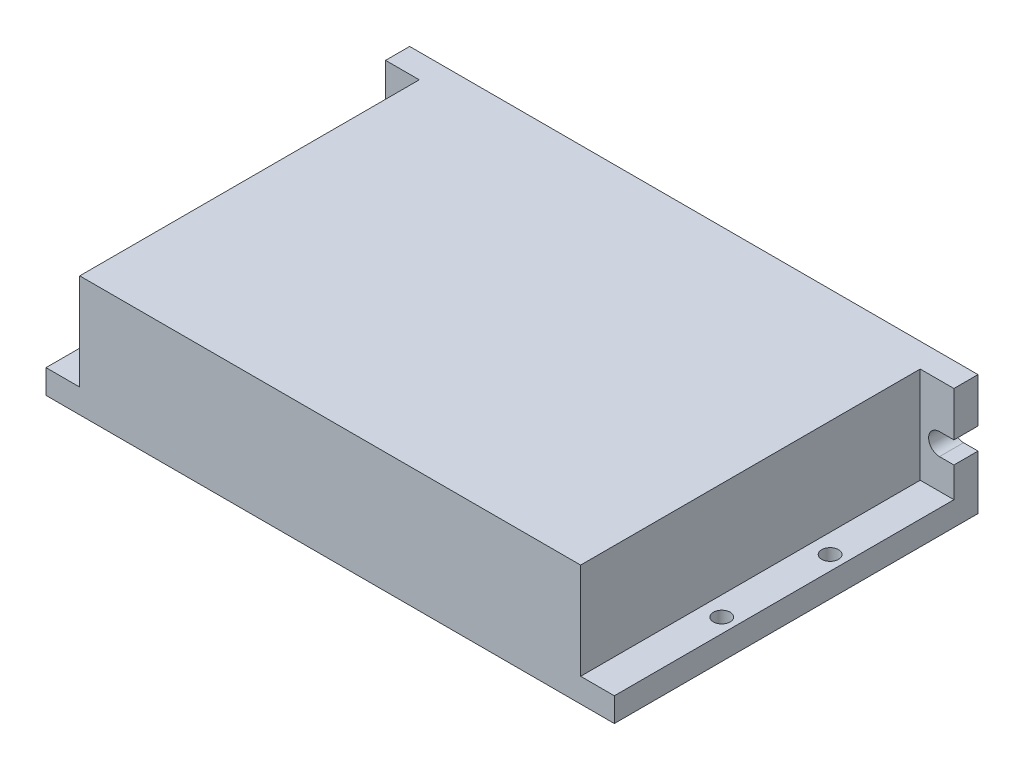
ISO-10303-21;
HEADER;
FILE_DESCRIPTION(('STEP AP214'),'2;1');
FILE_NAME('part.step','',(''),(''),'','','');
FILE_SCHEMA(('AUTOMOTIVE_DESIGN { 1 0 10303 214 1 1 1 1 }'));
ENDSEC;
DATA;
#1=APPLICATION_CONTEXT('core data for automotive mechanical design processes');
#2=APPLICATION_PROTOCOL_DEFINITION('international standard','automotive_design',2000,#1);
#3=PRODUCT_CONTEXT('',#1,'mechanical');
#4=PRODUCT('Part','Part','',(#3));
#5=PRODUCT_RELATED_PRODUCT_CATEGORY('part','',(#4));
#6=PRODUCT_DEFINITION_FORMATION('','',#4);
#7=PRODUCT_DEFINITION_CONTEXT('part definition',#1,'design');
#8=PRODUCT_DEFINITION('design','',#6,#7);
#9=PRODUCT_DEFINITION_SHAPE('','',#8);
#10=(LENGTH_UNIT() NAMED_UNIT(*) SI_UNIT(.MILLI.,.METRE.));
#11=(NAMED_UNIT(*) PLANE_ANGLE_UNIT() SI_UNIT($,.RADIAN.));
#12=(NAMED_UNIT(*) SI_UNIT($,.STERADIAN.) SOLID_ANGLE_UNIT());
#13=UNCERTAINTY_MEASURE_WITH_UNIT(LENGTH_MEASURE(1.E-05),#10,'distance_accuracy_value','');
#14=(GEOMETRIC_REPRESENTATION_CONTEXT(3) GLOBAL_UNCERTAINTY_ASSIGNED_CONTEXT((#13)) GLOBAL_UNIT_ASSIGNED_CONTEXT((#10,
#11,#12)) REPRESENTATION_CONTEXT('',''));
#15=CARTESIAN_POINT('',(0.,0.,0.));
#16=DIRECTION('',(0.,0.,1.));
#17=DIRECTION('',(1.,0.,0.));
#18=AXIS2_PLACEMENT_3D('',#15,#16,#17);
#19=CARTESIAN_POINT('',(59.,25.,37.75));
#20=DIRECTION('',(-1.,0.,0.));
#21=DIRECTION('',(0.,0.,1.));
#22=AXIS2_PLACEMENT_3D('',#19,#20,#21);
#23=PLANE('',#22);
#24=DIRECTION('',(0.,-1.,0.));
#25=VECTOR('',#24,1.);
#26=CARTESIAN_POINT('',(59.,25.,-37.75));
#27=LINE('',#26,#25);
#28=CARTESIAN_POINT('',(59.,11.25,-37.75));
#29=VERTEX_POINT('',#28);
#30=CARTESIAN_POINT('',(59.,0.,-37.75));
#31=VERTEX_POINT('',#30);
#32=EDGE_CURVE('E43',#29,#31,#27,.T.);
#33=ORIENTED_EDGE('',*,*,#32,.F.);
#34=DIRECTION('',(0.,0.,1.));
#35=VECTOR('',#34,1.);
#36=CARTESIAN_POINT('',(59.,11.25,-37.75));
#37=LINE('',#36,#35);
#38=CARTESIAN_POINT('',(59.,11.25,-32.75));
#39=VERTEX_POINT('',#38);
#40=EDGE_CURVE('E325',#29,#39,#37,.T.);
#41=ORIENTED_EDGE('',*,*,#40,.T.);
#42=DIRECTION('',(0.,1.,0.));
#43=VECTOR('',#42,1.);
#44=CARTESIAN_POINT('',(59.,5.,-32.75));
#45=LINE('',#44,#43);
#46=CARTESIAN_POINT('',(59.,5.,-32.75));
#47=VERTEX_POINT('',#46);
#48=EDGE_CURVE('E284',#47,#39,#45,.T.);
#49=ORIENTED_EDGE('',*,*,#48,.F.);
#50=DIRECTION('',(0.,0.,1.));
#51=VECTOR('',#50,1.);
#52=CARTESIAN_POINT('',(59.,5.,-32.75));
#53=LINE('',#52,#51);
#54=CARTESIAN_POINT('',(59.,5.,37.75));
#55=VERTEX_POINT('',#54);
#56=EDGE_CURVE('E254',#47,#55,#53,.T.);
#57=ORIENTED_EDGE('',*,*,#56,.T.);
#58=DIRECTION('',(0.,-1.,0.));
#59=VECTOR('',#58,1.);
#60=CARTESIAN_POINT('',(59.,25.,37.75));
#61=LINE('',#60,#59);
#62=CARTESIAN_POINT('',(59.,0.,37.75));
#63=VERTEX_POINT('',#62);
#64=EDGE_CURVE('E196',#55,#63,#61,.T.);
#65=ORIENTED_EDGE('',*,*,#64,.T.);
#66=DIRECTION('',(0.,0.,-1.));
#67=VECTOR('',#66,1.);
#68=CARTESIAN_POINT('',(59.,0.,37.75));
#69=LINE('',#68,#67);
#70=EDGE_CURVE('E197',#63,#31,#69,.T.);
#71=ORIENTED_EDGE('',*,*,#70,.T.);
#72=EDGE_LOOP('',(#33,#41,#49,#57,#65,#71));
#73=FACE_BOUND('',#72,.T.);
#74=ADVANCED_FACE('F35',(#73),#23,.F.);
#75=CARTESIAN_POINT('',(-59.,25.,37.75));
#76=DIRECTION('',(1.,0.,0.));
#77=DIRECTION('',(0.,0.,-1.));
#78=AXIS2_PLACEMENT_3D('',#75,#76,#77);
#79=PLANE('',#78);
#80=DIRECTION('',(0.,-1.,0.));
#81=VECTOR('',#80,1.);
#82=CARTESIAN_POINT('',(-59.,5.,-32.75));
#83=LINE('',#82,#81);
#84=CARTESIAN_POINT('',(-59.,11.25,-32.75));
#85=VERTEX_POINT('',#84);
#86=CARTESIAN_POINT('',(-59.,5.,-32.75));
#87=VERTEX_POINT('',#86);
#88=EDGE_CURVE('E241',#85,#87,#83,.T.);
#89=ORIENTED_EDGE('',*,*,#88,.F.);
#90=DIRECTION('',(0.,0.,1.));
#91=VECTOR('',#90,1.);
#92=CARTESIAN_POINT('',(-59.,11.25,-37.75));
#93=LINE('',#92,#91);
#94=CARTESIAN_POINT('',(-59.,11.25,-37.75));
#95=VERTEX_POINT('',#94);
#96=EDGE_CURVE('E222',#95,#85,#93,.T.);
#97=ORIENTED_EDGE('',*,*,#96,.F.);
#98=DIRECTION('',(0.,-1.,0.));
#99=VECTOR('',#98,1.);
#100=CARTESIAN_POINT('',(-59.,25.,-37.75));
#101=LINE('',#100,#99);
#102=CARTESIAN_POINT('',(-59.,0.,-37.75));
#103=VERTEX_POINT('',#102);
#104=EDGE_CURVE('E211',#95,#103,#101,.T.);
#105=ORIENTED_EDGE('',*,*,#104,.T.);
#106=DIRECTION('',(0.,0.,1.));
#107=VECTOR('',#106,1.);
#108=CARTESIAN_POINT('',(-59.,0.,37.75));
#109=LINE('',#108,#107);
#110=CARTESIAN_POINT('',(-59.,0.,37.75));
#111=VERTEX_POINT('',#110);
#112=EDGE_CURVE('E204',#103,#111,#109,.T.);
#113=ORIENTED_EDGE('',*,*,#112,.T.);
#114=DIRECTION('',(0.,-1.,0.));
#115=VECTOR('',#114,1.);
#116=CARTESIAN_POINT('',(-59.,25.,37.75));
#117=LINE('',#116,#115);
#118=CARTESIAN_POINT('',(-59.,5.,37.75));
#119=VERTEX_POINT('',#118);
#120=EDGE_CURVE('E210',#119,#111,#117,.T.);
#121=ORIENTED_EDGE('',*,*,#120,.F.);
#122=DIRECTION('',(0.,0.,1.));
#123=VECTOR('',#122,1.);
#124=CARTESIAN_POINT('',(-59.,5.,-32.75));
#125=LINE('',#124,#123);
#126=EDGE_CURVE('E240',#87,#119,#125,.T.);
#127=ORIENTED_EDGE('',*,*,#126,.F.);
#128=EDGE_LOOP('',(#89,#97,#105,#113,#121,#127));
#129=FACE_BOUND('',#128,.T.);
#130=ADVANCED_FACE('F218',(#129),#79,.F.);
#131=CARTESIAN_POINT('',(0.,0.,0.));
#132=DIRECTION('',(0.,-1.,0.));
#133=DIRECTION('',(0.,0.,-1.));
#134=AXIS2_PLACEMENT_3D('',#131,#132,#133);
#135=PLANE('',#134);
#136=CARTESIAN_POINT('',(56.,0.,-10.05));
#137=DIRECTION('',(0.,1.,0.));
#138=DIRECTION('',(0.,0.,1.));
#139=AXIS2_PLACEMENT_3D('',#136,#137,#138);
#140=CIRCLE('',#139,1.75);
#141=CARTESIAN_POINT('',(56.,0.,-8.3));
#142=VERTEX_POINT('',#141);
#143=EDGE_CURVE('E299',#142,#142,#140,.T.);
#144=ORIENTED_EDGE('',*,*,#143,.T.);
#145=EDGE_LOOP('',(#144));
#146=FACE_BOUND('',#145,.T.);
#147=CARTESIAN_POINT('',(-56.,0.,-10.05));
#148=DIRECTION('',(0.,1.,0.));
#149=DIRECTION('',(0.,0.,1.));
#150=AXIS2_PLACEMENT_3D('',#147,#148,#149);
#151=CIRCLE('',#150,1.75);
#152=CARTESIAN_POINT('',(-56.,0.,-8.3));
#153=VERTEX_POINT('',#152);
#154=EDGE_CURVE('E287',#153,#153,#151,.T.);
#155=ORIENTED_EDGE('',*,*,#154,.T.);
#156=EDGE_LOOP('',(#155));
#157=FACE_BOUND('',#156,.T.);
#158=ORIENTED_EDGE('',*,*,#70,.F.);
#159=DIRECTION('',(1.,0.,0.));
#160=VECTOR('',#159,1.);
#161=CARTESIAN_POINT('',(-59.,0.,37.75));
#162=LINE('',#161,#160);
#163=EDGE_CURVE('E190',#111,#63,#162,.T.);
#164=ORIENTED_EDGE('',*,*,#163,.F.);
#165=ORIENTED_EDGE('',*,*,#112,.F.);
#166=DIRECTION('',(-1.,0.,0.));
#167=VECTOR('',#166,1.);
#168=CARTESIAN_POINT('',(-59.,0.,-37.75));
#169=LINE('',#168,#167);
#170=EDGE_CURVE('E200',#31,#103,#169,.T.);
#171=ORIENTED_EDGE('',*,*,#170,.F.);
#172=EDGE_LOOP('',(#158,#164,#165,#171));
#173=FACE_BOUND('',#172,.T.);
#174=CARTESIAN_POINT('',(-56.,0.,12.45));
#175=DIRECTION('',(0.,1.,0.));
#176=DIRECTION('',(0.,0.,1.));
#177=AXIS2_PLACEMENT_3D('',#174,#175,#176);
#178=CIRCLE('',#177,1.75);
#179=CARTESIAN_POINT('',(-56.,0.,14.2));
#180=VERTEX_POINT('',#179);
#181=EDGE_CURVE('E293',#180,#180,#178,.T.);
#182=ORIENTED_EDGE('',*,*,#181,.T.);
#183=EDGE_LOOP('',(#182));
#184=FACE_BOUND('',#183,.T.);
#185=CARTESIAN_POINT('',(56.,0.,12.45));
#186=DIRECTION('',(0.,1.,0.));
#187=DIRECTION('',(0.,0.,1.));
#188=AXIS2_PLACEMENT_3D('',#185,#186,#187);
#189=CIRCLE('',#188,1.75);
#190=CARTESIAN_POINT('',(56.,0.,14.2));
#191=VERTEX_POINT('',#190);
#192=EDGE_CURVE('E305',#191,#191,#189,.T.);
#193=ORIENTED_EDGE('',*,*,#192,.T.);
#194=EDGE_LOOP('',(#193));
#195=FACE_BOUND('',#194,.T.);
#196=ADVANCED_FACE('F229',(#146,#157,#173,#184,#195),#135,.T.);
#197=CARTESIAN_POINT('',(52.,5.,-32.75));
#198=DIRECTION('',(0.,-1.,0.));
#199=DIRECTION('',(0.,0.,-1.));
#200=AXIS2_PLACEMENT_3D('',#197,#198,#199);
#201=PLANE('',#200);
#202=CARTESIAN_POINT('',(56.,5.,-10.05));
#203=DIRECTION('',(0.,1.,0.));
#204=DIRECTION('',(0.,0.,1.));
#205=AXIS2_PLACEMENT_3D('',#202,#203,#204);
#206=CIRCLE('',#205,1.75);
#207=CARTESIAN_POINT('',(56.,5.,-8.3));
#208=VERTEX_POINT('',#207);
#209=EDGE_CURVE('E296',#208,#208,#206,.T.);
#210=ORIENTED_EDGE('',*,*,#209,.F.);
#211=EDGE_LOOP('',(#210));
#212=FACE_BOUND('',#211,.T.);
#213=DIRECTION('',(1.,0.,0.));
#214=VECTOR('',#213,1.);
#215=CARTESIAN_POINT('',(52.,5.,37.75));
#216=LINE('',#215,#214);
#217=CARTESIAN_POINT('',(52.,5.,37.75));
#218=VERTEX_POINT('',#217);
#219=EDGE_CURVE('E270',#218,#55,#216,.T.);
#220=ORIENTED_EDGE('',*,*,#219,.T.);
#221=ORIENTED_EDGE('',*,*,#56,.F.);
#222=DIRECTION('',(1.,0.,0.));
#223=VECTOR('',#222,1.);
#224=CARTESIAN_POINT('',(52.,5.,-32.75));
#225=LINE('',#224,#223);
#226=CARTESIAN_POINT('',(52.,5.,-32.75));
#227=VERTEX_POINT('',#226);
#228=EDGE_CURVE('E266',#227,#47,#225,.T.);
#229=ORIENTED_EDGE('',*,*,#228,.F.);
#230=DIRECTION('',(0.,0.,1.));
#231=VECTOR('',#230,1.);
#232=CARTESIAN_POINT('',(52.,5.,-32.75));
#233=LINE('',#232,#231);
#234=EDGE_CURVE('E265',#227,#218,#233,.T.);
#235=ORIENTED_EDGE('',*,*,#234,.T.);
#236=EDGE_LOOP('',(#220,#221,#229,#235));
#237=FACE_BOUND('',#236,.T.);
#238=CARTESIAN_POINT('',(56.,5.,12.45));
#239=DIRECTION('',(0.,1.,0.));
#240=DIRECTION('',(0.,0.,1.));
#241=AXIS2_PLACEMENT_3D('',#238,#239,#240);
#242=CIRCLE('',#241,1.75);
#243=CARTESIAN_POINT('',(56.,5.,14.2));
#244=VERTEX_POINT('',#243);
#245=EDGE_CURVE('E302',#244,#244,#242,.T.);
#246=ORIENTED_EDGE('',*,*,#245,.F.);
#247=EDGE_LOOP('',(#246));
#248=FACE_BOUND('',#247,.T.);
#249=ADVANCED_FACE('F356',(#212,#237,#248),#201,.F.);
#250=CARTESIAN_POINT('',(-52.,5.,-32.75));
#251=DIRECTION('',(0.,-1.,0.));
#252=DIRECTION('',(0.,0.,-1.));
#253=AXIS2_PLACEMENT_3D('',#250,#251,#252);
#254=PLANE('',#253);
#255=CARTESIAN_POINT('',(-56.,5.,-10.05));
#256=DIRECTION('',(0.,1.,0.));
#257=DIRECTION('',(0.,0.,1.));
#258=AXIS2_PLACEMENT_3D('',#255,#256,#257);
#259=CIRCLE('',#258,1.75);
#260=CARTESIAN_POINT('',(-56.,5.,-8.3));
#261=VERTEX_POINT('',#260);
#262=EDGE_CURVE('E275',#261,#261,#259,.T.);
#263=ORIENTED_EDGE('',*,*,#262,.F.);
#264=EDGE_LOOP('',(#263));
#265=FACE_BOUND('',#264,.T.);
#266=DIRECTION('',(1.,0.,0.));
#267=VECTOR('',#266,1.);
#268=CARTESIAN_POINT('',(-52.,5.,37.75));
#269=LINE('',#268,#267);
#270=CARTESIAN_POINT('',(-52.,5.,37.75));
#271=VERTEX_POINT('',#270);
#272=EDGE_CURVE('E238',#119,#271,#269,.T.);
#273=ORIENTED_EDGE('',*,*,#272,.T.);
#274=DIRECTION('',(0.,0.,1.));
#275=VECTOR('',#274,1.);
#276=CARTESIAN_POINT('',(-52.,5.,-32.75));
#277=LINE('',#276,#275);
#278=CARTESIAN_POINT('',(-52.,5.,-32.75));
#279=VERTEX_POINT('',#278);
#280=EDGE_CURVE('E244',#279,#271,#277,.T.);
#281=ORIENTED_EDGE('',*,*,#280,.F.);
#282=DIRECTION('',(1.,0.,0.));
#283=VECTOR('',#282,1.);
#284=CARTESIAN_POINT('',(-52.,5.,-32.75));
#285=LINE('',#284,#283);
#286=EDGE_CURVE('E257',#87,#279,#285,.T.);
#287=ORIENTED_EDGE('',*,*,#286,.F.);
#288=ORIENTED_EDGE('',*,*,#126,.T.);
#289=EDGE_LOOP('',(#273,#281,#287,#288));
#290=FACE_BOUND('',#289,.T.);
#291=CARTESIAN_POINT('',(-56.,5.,12.45));
#292=DIRECTION('',(0.,1.,0.));
#293=DIRECTION('',(0.,0.,1.));
#294=AXIS2_PLACEMENT_3D('',#291,#292,#293);
#295=CIRCLE('',#294,1.75);
#296=CARTESIAN_POINT('',(-56.,5.,14.2));
#297=VERTEX_POINT('',#296);
#298=EDGE_CURVE('E290',#297,#297,#295,.T.);
#299=ORIENTED_EDGE('',*,*,#298,.F.);
#300=EDGE_LOOP('',(#299));
#301=FACE_BOUND('',#300,.T.);
#302=ADVANCED_FACE('F369',(#265,#290,#301),#254,.F.);
#303=CARTESIAN_POINT('',(59.,15.75,-32.75));
#304=VERTEX_POINT('',#303);
#305=CARTESIAN_POINT('',(59.,25.,-32.75));
#306=VERTEX_POINT('',#305);
#307=EDGE_CURVE('E172',#304,#306,#45,.T.);
#308=ORIENTED_EDGE('',*,*,#307,.F.);
#309=DIRECTION('',(0.,0.,1.));
#310=VECTOR('',#309,1.);
#311=CARTESIAN_POINT('',(59.,15.75,-37.75));
#312=LINE('',#311,#310);
#313=CARTESIAN_POINT('',(59.,15.75,-37.75));
#314=VERTEX_POINT('',#313);
#315=EDGE_CURVE('E50',#314,#304,#312,.T.);
#316=ORIENTED_EDGE('',*,*,#315,.F.);
#317=CARTESIAN_POINT('',(59.,25.,-37.75));
#318=VERTEX_POINT('',#317);
#319=EDGE_CURVE('E11',#318,#314,#27,.T.);
#320=ORIENTED_EDGE('',*,*,#319,.F.);
#321=DIRECTION('',(0.,0.,-1.));
#322=VECTOR('',#321,1.);
#323=CARTESIAN_POINT('',(59.,25.,37.75));
#324=LINE('',#323,#322);
#325=EDGE_CURVE('E186',#306,#318,#324,.T.);
#326=ORIENTED_EDGE('',*,*,#325,.F.);
#327=EDGE_LOOP('',(#308,#316,#320,#326));
#328=FACE_BOUND('',#327,.T.);
#329=ADVANCED_FACE('F37',(#328),#23,.F.);
#330=CARTESIAN_POINT('',(-59.,25.,-37.75));
#331=DIRECTION('',(0.,0.,1.));
#332=DIRECTION('',(1.,0.,0.));
#333=AXIS2_PLACEMENT_3D('',#330,#331,#332);
#334=PLANE('',#333);
#335=CARTESIAN_POINT('',(56.,13.5,-37.75));
#336=DIRECTION('',(0.,0.,1.));
#337=DIRECTION('',(1.,0.,0.));
#338=AXIS2_PLACEMENT_3D('',#335,#336,#337);
#339=CIRCLE('',#338,2.25);
#340=CARTESIAN_POINT('',(56.,15.75,-37.75));
#341=VERTEX_POINT('',#340);
#342=CARTESIAN_POINT('',(56.,11.25,-37.75));
#343=VERTEX_POINT('',#342);
#344=EDGE_CURVE('E165',#341,#343,#339,.T.);
#345=ORIENTED_EDGE('',*,*,#344,.T.);
#346=DIRECTION('',(1.,0.,0.));
#347=VECTOR('',#346,1.);
#348=CARTESIAN_POINT('',(56.,11.25,-37.75));
#349=LINE('',#348,#347);
#350=EDGE_CURVE('E173',#343,#29,#349,.T.);
#351=ORIENTED_EDGE('',*,*,#350,.T.);
#352=ORIENTED_EDGE('',*,*,#32,.T.);
#353=ORIENTED_EDGE('',*,*,#170,.T.);
#354=ORIENTED_EDGE('',*,*,#104,.F.);
#355=DIRECTION('',(1.,0.,0.));
#356=VECTOR('',#355,1.);
#357=CARTESIAN_POINT('',(-56.,11.25,-37.75));
#358=LINE('',#357,#356);
#359=CARTESIAN_POINT('',(-56.,11.25,-37.75));
#360=VERTEX_POINT('',#359);
#361=EDGE_CURVE('E314',#95,#360,#358,.T.);
#362=ORIENTED_EDGE('',*,*,#361,.T.);
#363=CARTESIAN_POINT('',(-56.,13.5,-37.75));
#364=DIRECTION('',(0.,0.,1.));
#365=DIRECTION('',(-1.,0.,0.));
#366=AXIS2_PLACEMENT_3D('',#363,#364,#365);
#367=CIRCLE('',#366,2.25);
#368=CARTESIAN_POINT('',(-56.,15.75,-37.75));
#369=VERTEX_POINT('',#368);
#370=EDGE_CURVE('E321',#360,#369,#367,.T.);
#371=ORIENTED_EDGE('',*,*,#370,.T.);
#372=DIRECTION('',(-1.,0.,0.));
#373=VECTOR('',#372,1.);
#374=CARTESIAN_POINT('',(-56.,15.75,-37.75));
#375=LINE('',#374,#373);
#376=CARTESIAN_POINT('',(-59.,15.75,-37.75));
#377=VERTEX_POINT('',#376);
#378=EDGE_CURVE('E327',#369,#377,#375,.T.);
#379=ORIENTED_EDGE('',*,*,#378,.T.);
#380=CARTESIAN_POINT('',(-59.,25.,-37.75));
#381=VERTEX_POINT('',#380);
#382=EDGE_CURVE('E181',#381,#377,#101,.T.);
#383=ORIENTED_EDGE('',*,*,#382,.F.);
#384=DIRECTION('',(-1.,0.,0.));
#385=VECTOR('',#384,1.);
#386=CARTESIAN_POINT('',(-59.,25.,-37.75));
#387=LINE('',#386,#385);
#388=EDGE_CURVE('E178',#318,#381,#387,.T.);
#389=ORIENTED_EDGE('',*,*,#388,.F.);
#390=ORIENTED_EDGE('',*,*,#319,.T.);
#391=DIRECTION('',(-1.,0.,0.));
#392=VECTOR('',#391,1.);
#393=CARTESIAN_POINT('',(56.,15.75,-37.75));
#394=LINE('',#393,#392);
#395=EDGE_CURVE('E159',#314,#341,#394,.T.);
#396=ORIENTED_EDGE('',*,*,#395,.T.);
#397=EDGE_LOOP('',(#345,#351,#352,#353,#354,#362,#371,#379,#383,#389,#390,#396));
#398=FACE_BOUND('',#397,.T.);
#399=ADVANCED_FACE('F176',(#398),#334,.F.);
#400=ORIENTED_EDGE('',*,*,#382,.T.);
#401=DIRECTION('',(0.,0.,1.));
#402=VECTOR('',#401,1.);
#403=CARTESIAN_POINT('',(-59.,15.75,-37.75));
#404=LINE('',#403,#402);
#405=CARTESIAN_POINT('',(-59.,15.75,-32.75));
#406=VERTEX_POINT('',#405);
#407=EDGE_CURVE('E313',#377,#406,#404,.T.);
#408=ORIENTED_EDGE('',*,*,#407,.T.);
#409=CARTESIAN_POINT('',(-59.,25.,-32.75));
#410=VERTEX_POINT('',#409);
#411=EDGE_CURVE('E260',#410,#406,#83,.T.);
#412=ORIENTED_EDGE('',*,*,#411,.F.);
#413=DIRECTION('',(0.,0.,1.));
#414=VECTOR('',#413,1.);
#415=CARTESIAN_POINT('',(-59.,25.,37.75));
#416=LINE('',#415,#414);
#417=EDGE_CURVE('E185',#381,#410,#416,.T.);
#418=ORIENTED_EDGE('',*,*,#417,.F.);
#419=EDGE_LOOP('',(#400,#408,#412,#418));
#420=FACE_BOUND('',#419,.T.);
#421=ADVANCED_FACE('F407',(#420),#79,.F.);
#422=CARTESIAN_POINT('',(-59.,25.,37.75));
#423=DIRECTION('',(0.,0.,-1.));
#424=DIRECTION('',(-1.,0.,0.));
#425=AXIS2_PLACEMENT_3D('',#422,#423,#424);
#426=PLANE('',#425);
#427=ORIENTED_EDGE('',*,*,#64,.F.);
#428=ORIENTED_EDGE('',*,*,#219,.F.);
#429=DIRECTION('',(0.,-1.,0.));
#430=VECTOR('',#429,1.);
#431=CARTESIAN_POINT('',(52.,25.,37.75));
#432=LINE('',#431,#430);
#433=CARTESIAN_POINT('',(52.,25.,37.75));
#434=VERTEX_POINT('',#433);
#435=EDGE_CURVE('E272',#434,#218,#432,.T.);
#436=ORIENTED_EDGE('',*,*,#435,.F.);
#437=DIRECTION('',(1.,0.,0.));
#438=VECTOR('',#437,1.);
#439=CARTESIAN_POINT('',(-59.,25.,37.75));
#440=LINE('',#439,#438);
#441=CARTESIAN_POINT('',(-52.,25.,37.75));
#442=VERTEX_POINT('',#441);
#443=EDGE_CURVE('E188',#442,#434,#440,.T.);
#444=ORIENTED_EDGE('',*,*,#443,.F.);
#445=DIRECTION('',(0.,1.,0.));
#446=VECTOR('',#445,1.);
#447=CARTESIAN_POINT('',(-52.,25.,37.75));
#448=LINE('',#447,#446);
#449=EDGE_CURVE('E252',#271,#442,#448,.T.);
#450=ORIENTED_EDGE('',*,*,#449,.F.);
#451=ORIENTED_EDGE('',*,*,#272,.F.);
#452=ORIENTED_EDGE('',*,*,#120,.T.);
#453=ORIENTED_EDGE('',*,*,#163,.T.);
#454=EDGE_LOOP('',(#427,#428,#436,#444,#450,#451,#452,#453));
#455=FACE_BOUND('',#454,.T.);
#456=ADVANCED_FACE('F233',(#455),#426,.F.);
#457=CARTESIAN_POINT('',(0.,25.,0.));
#458=DIRECTION('',(0.,-1.,0.));
#459=DIRECTION('',(0.,0.,-1.));
#460=AXIS2_PLACEMENT_3D('',#457,#458,#459);
#461=PLANE('',#460);
#462=ORIENTED_EDGE('',*,*,#443,.T.);
#463=DIRECTION('',(0.,0.,1.));
#464=VECTOR('',#463,1.);
#465=CARTESIAN_POINT('',(52.,25.,-32.75));
#466=LINE('',#465,#464);
#467=CARTESIAN_POINT('',(52.,25.,-32.75));
#468=VERTEX_POINT('',#467);
#469=EDGE_CURVE('E263',#468,#434,#466,.T.);
#470=ORIENTED_EDGE('',*,*,#469,.F.);
#471=DIRECTION('',(-1.,0.,0.));
#472=VECTOR('',#471,1.);
#473=CARTESIAN_POINT('',(59.,25.,-32.75));
#474=LINE('',#473,#472);
#475=EDGE_CURVE('E281',#306,#468,#474,.T.);
#476=ORIENTED_EDGE('',*,*,#475,.F.);
#477=ORIENTED_EDGE('',*,*,#325,.T.);
#478=ORIENTED_EDGE('',*,*,#388,.T.);
#479=ORIENTED_EDGE('',*,*,#417,.T.);
#480=DIRECTION('',(-1.,0.,0.));
#481=VECTOR('',#480,1.);
#482=CARTESIAN_POINT('',(-59.,25.,-32.75));
#483=LINE('',#482,#481);
#484=CARTESIAN_POINT('',(-52.,25.,-32.75));
#485=VERTEX_POINT('',#484);
#486=EDGE_CURVE('E245',#485,#410,#483,.T.);
#487=ORIENTED_EDGE('',*,*,#486,.F.);
#488=DIRECTION('',(0.,0.,1.));
#489=VECTOR('',#488,1.);
#490=CARTESIAN_POINT('',(-52.,25.,-32.75));
#491=LINE('',#490,#489);
#492=EDGE_CURVE('E201',#485,#442,#491,.T.);
#493=ORIENTED_EDGE('',*,*,#492,.T.);
#494=EDGE_LOOP('',(#462,#470,#476,#477,#478,#479,#487,#493));
#495=FACE_BOUND('',#494,.T.);
#496=ADVANCED_FACE('F362',(#495),#461,.F.);
#497=CARTESIAN_POINT('',(-52.,25.,-32.75));
#498=DIRECTION('',(1.,0.,0.));
#499=DIRECTION('',(0.,0.,-1.));
#500=AXIS2_PLACEMENT_3D('',#497,#498,#499);
#501=PLANE('',#500);
#502=ORIENTED_EDGE('',*,*,#449,.T.);
#503=ORIENTED_EDGE('',*,*,#492,.F.);
#504=DIRECTION('',(0.,1.,0.));
#505=VECTOR('',#504,1.);
#506=CARTESIAN_POINT('',(-52.,25.,-32.75));
#507=LINE('',#506,#505);
#508=EDGE_CURVE('E247',#279,#485,#507,.T.);
#509=ORIENTED_EDGE('',*,*,#508,.F.);
#510=ORIENTED_EDGE('',*,*,#280,.T.);
#511=EDGE_LOOP('',(#502,#503,#509,#510));
#512=FACE_BOUND('',#511,.T.);
#513=ADVANCED_FACE('F368',(#512),#501,.F.);
#514=CARTESIAN_POINT('',(0.,0.,-32.75));
#515=DIRECTION('',(0.,0.,-1.));
#516=DIRECTION('',(-1.,0.,0.));
#517=AXIS2_PLACEMENT_3D('',#514,#515,#516);
#518=PLANE('',#517);
#519=CARTESIAN_POINT('',(-56.,13.5,-32.75));
#520=DIRECTION('',(0.,0.,1.));
#521=DIRECTION('',(-1.,0.,0.));
#522=AXIS2_PLACEMENT_3D('',#519,#520,#521);
#523=CIRCLE('',#522,2.25);
#524=CARTESIAN_POINT('',(-56.,11.25,-32.75));
#525=VERTEX_POINT('',#524);
#526=CARTESIAN_POINT('',(-56.,15.75,-32.75));
#527=VERTEX_POINT('',#526);
#528=EDGE_CURVE('E58',#525,#527,#523,.T.);
#529=ORIENTED_EDGE('',*,*,#528,.F.);
#530=DIRECTION('',(1.,0.,0.));
#531=VECTOR('',#530,1.);
#532=CARTESIAN_POINT('',(-56.,11.25,-32.75));
#533=LINE('',#532,#531);
#534=EDGE_CURVE('E318',#85,#525,#533,.T.);
#535=ORIENTED_EDGE('',*,*,#534,.F.);
#536=ORIENTED_EDGE('',*,*,#88,.T.);
#537=ORIENTED_EDGE('',*,*,#286,.T.);
#538=ORIENTED_EDGE('',*,*,#508,.T.);
#539=ORIENTED_EDGE('',*,*,#486,.T.);
#540=ORIENTED_EDGE('',*,*,#411,.T.);
#541=DIRECTION('',(-1.,0.,0.));
#542=VECTOR('',#541,1.);
#543=CARTESIAN_POINT('',(-56.,15.75,-32.75));
#544=LINE('',#543,#542);
#545=EDGE_CURVE('E322',#527,#406,#544,.T.);
#546=ORIENTED_EDGE('',*,*,#545,.F.);
#547=EDGE_LOOP('',(#529,#535,#536,#537,#538,#539,#540,#546));
#548=FACE_BOUND('',#547,.T.);
#549=ADVANCED_FACE('F422',(#548),#518,.F.);
#550=CARTESIAN_POINT('',(52.,25.,-32.75));
#551=DIRECTION('',(-1.,0.,0.));
#552=DIRECTION('',(0.,0.,1.));
#553=AXIS2_PLACEMENT_3D('',#550,#551,#552);
#554=PLANE('',#553);
#555=ORIENTED_EDGE('',*,*,#435,.T.);
#556=ORIENTED_EDGE('',*,*,#234,.F.);
#557=DIRECTION('',(0.,-1.,0.));
#558=VECTOR('',#557,1.);
#559=CARTESIAN_POINT('',(52.,25.,-32.75));
#560=LINE('',#559,#558);
#561=EDGE_CURVE('E278',#468,#227,#560,.T.);
#562=ORIENTED_EDGE('',*,*,#561,.F.);
#563=ORIENTED_EDGE('',*,*,#469,.T.);
#564=EDGE_LOOP('',(#555,#556,#562,#563));
#565=FACE_BOUND('',#564,.T.);
#566=ADVANCED_FACE('F425',(#565),#554,.F.);
#567=CARTESIAN_POINT('',(0.,0.,-32.75));
#568=DIRECTION('',(0.,0.,1.));
#569=DIRECTION('',(1.,0.,0.));
#570=AXIS2_PLACEMENT_3D('',#567,#568,#569);
#571=PLANE('',#570);
#572=DIRECTION('',(1.,0.,0.));
#573=VECTOR('',#572,1.);
#574=CARTESIAN_POINT('',(56.,11.25,-32.75));
#575=LINE('',#574,#573);
#576=CARTESIAN_POINT('',(56.,11.25,-32.75));
#577=VERTEX_POINT('',#576);
#578=EDGE_CURVE('E166',#577,#39,#575,.T.);
#579=ORIENTED_EDGE('',*,*,#578,.F.);
#580=CARTESIAN_POINT('',(56.,13.5,-32.75));
#581=DIRECTION('',(0.,0.,1.));
#582=DIRECTION('',(1.,0.,0.));
#583=AXIS2_PLACEMENT_3D('',#580,#581,#582);
#584=CIRCLE('',#583,2.25);
#585=CARTESIAN_POINT('',(56.,15.75,-32.75));
#586=VERTEX_POINT('',#585);
#587=EDGE_CURVE('E337',#586,#577,#584,.T.);
#588=ORIENTED_EDGE('',*,*,#587,.F.);
#589=DIRECTION('',(-1.,0.,0.));
#590=VECTOR('',#589,1.);
#591=CARTESIAN_POINT('',(56.,15.75,-32.75));
#592=LINE('',#591,#590);
#593=EDGE_CURVE('E340',#304,#586,#592,.T.);
#594=ORIENTED_EDGE('',*,*,#593,.F.);
#595=ORIENTED_EDGE('',*,*,#307,.T.);
#596=ORIENTED_EDGE('',*,*,#475,.T.);
#597=ORIENTED_EDGE('',*,*,#561,.T.);
#598=ORIENTED_EDGE('',*,*,#228,.T.);
#599=ORIENTED_EDGE('',*,*,#48,.T.);
#600=EDGE_LOOP('',(#579,#588,#594,#595,#596,#597,#598,#599));
#601=FACE_BOUND('',#600,.T.);
#602=ADVANCED_FACE('F353',(#601),#571,.T.);
#603=CARTESIAN_POINT('',(-56.,5.,-10.05));
#604=DIRECTION('',(0.,-1.,0.));
#605=DIRECTION('',(0.,0.,-1.));
#606=AXIS2_PLACEMENT_3D('',#603,#604,#605);
#607=CYLINDRICAL_SURFACE('',#606,1.75);
#608=ORIENTED_EDGE('',*,*,#262,.T.);
#609=EDGE_LOOP('',(#608));
#610=FACE_BOUND('',#609,.T.);
#611=ORIENTED_EDGE('',*,*,#154,.F.);
#612=EDGE_LOOP('',(#611));
#613=FACE_BOUND('',#612,.T.);
#614=ADVANCED_FACE('F380',(#610,#613),#607,.F.);
#615=CARTESIAN_POINT('',(-56.,5.,12.45));
#616=DIRECTION('',(0.,-1.,0.));
#617=DIRECTION('',(0.,0.,-1.));
#618=AXIS2_PLACEMENT_3D('',#615,#616,#617);
#619=CYLINDRICAL_SURFACE('',#618,1.75);
#620=ORIENTED_EDGE('',*,*,#298,.T.);
#621=EDGE_LOOP('',(#620));
#622=FACE_BOUND('',#621,.T.);
#623=ORIENTED_EDGE('',*,*,#181,.F.);
#624=EDGE_LOOP('',(#623));
#625=FACE_BOUND('',#624,.T.);
#626=ADVANCED_FACE('F376',(#622,#625),#619,.F.);
#627=CARTESIAN_POINT('',(56.,5.,-10.05));
#628=DIRECTION('',(0.,-1.,0.));
#629=DIRECTION('',(0.,0.,-1.));
#630=AXIS2_PLACEMENT_3D('',#627,#628,#629);
#631=CYLINDRICAL_SURFACE('',#630,1.75);
#632=ORIENTED_EDGE('',*,*,#209,.T.);
#633=EDGE_LOOP('',(#632));
#634=FACE_BOUND('',#633,.T.);
#635=ORIENTED_EDGE('',*,*,#143,.F.);
#636=EDGE_LOOP('',(#635));
#637=FACE_BOUND('',#636,.T.);
#638=ADVANCED_FACE('F379',(#634,#637),#631,.F.);
#639=CARTESIAN_POINT('',(56.,5.,12.45));
#640=DIRECTION('',(0.,-1.,0.));
#641=DIRECTION('',(0.,0.,-1.));
#642=AXIS2_PLACEMENT_3D('',#639,#640,#641);
#643=CYLINDRICAL_SURFACE('',#642,1.75);
#644=ORIENTED_EDGE('',*,*,#245,.T.);
#645=EDGE_LOOP('',(#644));
#646=FACE_BOUND('',#645,.T.);
#647=ORIENTED_EDGE('',*,*,#192,.F.);
#648=EDGE_LOOP('',(#647));
#649=FACE_BOUND('',#648,.T.);
#650=ADVANCED_FACE('F389',(#646,#649),#643,.F.);
#651=CARTESIAN_POINT('',(-56.,13.5,-37.75));
#652=DIRECTION('',(0.,0.,1.));
#653=DIRECTION('',(1.,0.,0.));
#654=AXIS2_PLACEMENT_3D('',#651,#652,#653);
#655=CYLINDRICAL_SURFACE('',#654,2.25);
#656=ORIENTED_EDGE('',*,*,#528,.T.);
#657=DIRECTION('',(0.,0.,1.));
#658=VECTOR('',#657,1.);
#659=CARTESIAN_POINT('',(-56.,15.75,-37.75));
#660=LINE('',#659,#658);
#661=EDGE_CURVE('E311',#369,#527,#660,.T.);
#662=ORIENTED_EDGE('',*,*,#661,.F.);
#663=ORIENTED_EDGE('',*,*,#370,.F.);
#664=DIRECTION('',(0.,0.,1.));
#665=VECTOR('',#664,1.);
#666=CARTESIAN_POINT('',(-56.,11.25,-37.75));
#667=LINE('',#666,#665);
#668=EDGE_CURVE('E308',#360,#525,#667,.T.);
#669=ORIENTED_EDGE('',*,*,#668,.T.);
#670=EDGE_LOOP('',(#656,#662,#663,#669));
#671=FACE_BOUND('',#670,.T.);
#672=ADVANCED_FACE('F391',(#671),#655,.F.);
#673=CARTESIAN_POINT('',(-56.,11.25,-37.75));
#674=DIRECTION('',(0.,-1.,0.));
#675=DIRECTION('',(0.,0.,-1.));
#676=AXIS2_PLACEMENT_3D('',#673,#674,#675);
#677=PLANE('',#676);
#678=ORIENTED_EDGE('',*,*,#534,.T.);
#679=ORIENTED_EDGE('',*,*,#668,.F.);
#680=ORIENTED_EDGE('',*,*,#361,.F.);
#681=ORIENTED_EDGE('',*,*,#96,.T.);
#682=EDGE_LOOP('',(#678,#679,#680,#681));
#683=FACE_BOUND('',#682,.T.);
#684=ADVANCED_FACE('F398',(#683),#677,.F.);
#685=CARTESIAN_POINT('',(-56.,15.75,-37.75));
#686=DIRECTION('',(0.,1.,0.));
#687=DIRECTION('',(0.,0.,1.));
#688=AXIS2_PLACEMENT_3D('',#685,#686,#687);
#689=PLANE('',#688);
#690=ORIENTED_EDGE('',*,*,#545,.T.);
#691=ORIENTED_EDGE('',*,*,#407,.F.);
#692=ORIENTED_EDGE('',*,*,#378,.F.);
#693=ORIENTED_EDGE('',*,*,#661,.T.);
#694=EDGE_LOOP('',(#690,#691,#692,#693));
#695=FACE_BOUND('',#694,.T.);
#696=ADVANCED_FACE('F510',(#695),#689,.F.);
#697=CARTESIAN_POINT('',(56.,11.25,-37.75));
#698=DIRECTION('',(0.,-1.,0.));
#699=DIRECTION('',(0.,0.,-1.));
#700=AXIS2_PLACEMENT_3D('',#697,#698,#699);
#701=PLANE('',#700);
#702=ORIENTED_EDGE('',*,*,#578,.T.);
#703=ORIENTED_EDGE('',*,*,#40,.F.);
#704=ORIENTED_EDGE('',*,*,#350,.F.);
#705=DIRECTION('',(0.,0.,1.));
#706=VECTOR('',#705,1.);
#707=CARTESIAN_POINT('',(56.,11.25,-37.75));
#708=LINE('',#707,#706);
#709=EDGE_CURVE('E332',#343,#577,#708,.T.);
#710=ORIENTED_EDGE('',*,*,#709,.T.);
#711=EDGE_LOOP('',(#702,#703,#704,#710));
#712=FACE_BOUND('',#711,.T.);
#713=ADVANCED_FACE('F349',(#712),#701,.F.);
#714=CARTESIAN_POINT('',(56.,13.5,-37.75));
#715=DIRECTION('',(0.,0.,1.));
#716=DIRECTION('',(1.,0.,0.));
#717=AXIS2_PLACEMENT_3D('',#714,#715,#716);
#718=CYLINDRICAL_SURFACE('',#717,2.25);
#719=ORIENTED_EDGE('',*,*,#587,.T.);
#720=ORIENTED_EDGE('',*,*,#709,.F.);
#721=ORIENTED_EDGE('',*,*,#344,.F.);
#722=DIRECTION('',(0.,0.,1.));
#723=VECTOR('',#722,1.);
#724=CARTESIAN_POINT('',(56.,15.75,-37.75));
#725=LINE('',#724,#723);
#726=EDGE_CURVE('E161',#341,#586,#725,.T.);
#727=ORIENTED_EDGE('',*,*,#726,.T.);
#728=EDGE_LOOP('',(#719,#720,#721,#727));
#729=FACE_BOUND('',#728,.T.);
#730=ADVANCED_FACE('F345',(#729),#718,.F.);
#731=CARTESIAN_POINT('',(56.,15.75,-37.75));
#732=DIRECTION('',(0.,1.,0.));
#733=DIRECTION('',(0.,0.,1.));
#734=AXIS2_PLACEMENT_3D('',#731,#732,#733);
#735=PLANE('',#734);
#736=ORIENTED_EDGE('',*,*,#593,.T.);
#737=ORIENTED_EDGE('',*,*,#726,.F.);
#738=ORIENTED_EDGE('',*,*,#395,.F.);
#739=ORIENTED_EDGE('',*,*,#315,.T.);
#740=EDGE_LOOP('',(#736,#737,#738,#739));
#741=FACE_BOUND('',#740,.T.);
#742=ADVANCED_FACE('F160',(#741),#735,.F.);
#743=CLOSED_SHELL('',(#74,#130,#196,#249,#302,#329,#399,#421,#456,#496,#513,#549,#566,#602,#614,
#626,#638,#650,#672,#684,#696,#713,#730,#742));
#744=MANIFOLD_SOLID_BREP('B2',#743);
#745=ADVANCED_BREP_SHAPE_REPRESENTATION('',(#18,#744),#14);
#746=SHAPE_DEFINITION_REPRESENTATION(#9,#745);
ENDSEC;
END-ISO-10303-21;
